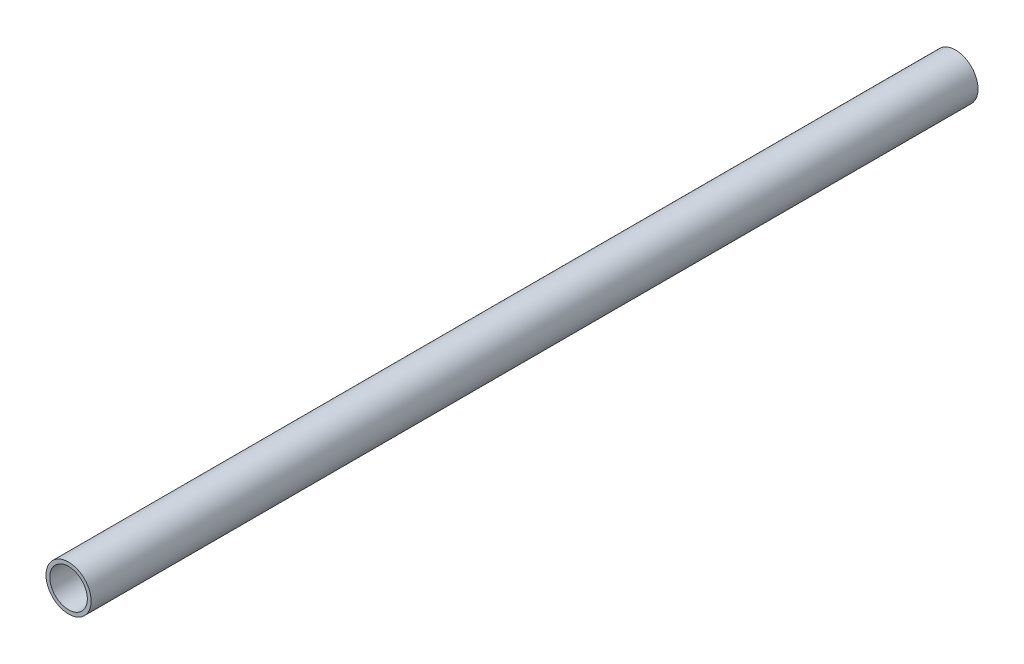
ISO-10303-21;
HEADER;
FILE_DESCRIPTION(('STEP AP214'),'2;1');
FILE_NAME('part.step','',(''),(''),'','','');
FILE_SCHEMA(('AUTOMOTIVE_DESIGN { 1 0 10303 214 1 1 1 1 }'));
ENDSEC;
DATA;
#1=APPLICATION_CONTEXT('core data for automotive mechanical design processes');
#2=APPLICATION_PROTOCOL_DEFINITION('international standard','automotive_design',2000,#1);
#3=PRODUCT_CONTEXT('',#1,'mechanical');
#4=PRODUCT('Part','Part','',(#3));
#5=PRODUCT_RELATED_PRODUCT_CATEGORY('part','',(#4));
#6=PRODUCT_DEFINITION_FORMATION('','',#4);
#7=PRODUCT_DEFINITION_CONTEXT('part definition',#1,'design');
#8=PRODUCT_DEFINITION('design','',#6,#7);
#9=PRODUCT_DEFINITION_SHAPE('','',#8);
#10=(LENGTH_UNIT() NAMED_UNIT(*) SI_UNIT(.MILLI.,.METRE.));
#11=(NAMED_UNIT(*) PLANE_ANGLE_UNIT() SI_UNIT($,.RADIAN.));
#12=(NAMED_UNIT(*) SI_UNIT($,.STERADIAN.) SOLID_ANGLE_UNIT());
#13=UNCERTAINTY_MEASURE_WITH_UNIT(LENGTH_MEASURE(1.E-05),#10,'distance_accuracy_value','');
#14=(GEOMETRIC_REPRESENTATION_CONTEXT(3) GLOBAL_UNCERTAINTY_ASSIGNED_CONTEXT((#13)) GLOBAL_UNIT_ASSIGNED_CONTEXT((#10,
#11,#12)) REPRESENTATION_CONTEXT('',''));
#15=CARTESIAN_POINT('',(0.,0.,0.));
#16=DIRECTION('',(0.,0.,1.));
#17=DIRECTION('',(1.,0.,0.));
#18=AXIS2_PLACEMENT_3D('',#15,#16,#17);
#19=CARTESIAN_POINT('',(0.,0.,236.));
#20=DIRECTION('',(0.,0.,-1.));
#21=DIRECTION('',(-1.,0.,0.));
#22=AXIS2_PLACEMENT_3D('',#19,#20,#21);
#23=CYLINDRICAL_SURFACE('',#22,5.);
#24=CARTESIAN_POINT('',(0.,0.,0.));
#25=DIRECTION('',(0.,0.,-1.));
#26=DIRECTION('',(-1.,0.,0.));
#27=AXIS2_PLACEMENT_3D('',#24,#25,#26);
#28=CIRCLE('',#27,5.);
#29=CARTESIAN_POINT('',(-5.,0.,0.));
#30=VERTEX_POINT('',#29);
#31=EDGE_CURVE('E27',#30,#30,#28,.T.);
#32=ORIENTED_EDGE('',*,*,#31,.T.);
#33=EDGE_LOOP('',(#32));
#34=FACE_BOUND('',#33,.T.);
#35=CARTESIAN_POINT('',(0.,0.,236.));
#36=DIRECTION('',(0.,0.,-1.));
#37=DIRECTION('',(-1.,0.,0.));
#38=AXIS2_PLACEMENT_3D('',#35,#36,#37);
#39=CIRCLE('',#38,5.);
#40=CARTESIAN_POINT('',(-5.,0.,236.));
#41=VERTEX_POINT('',#40);
#42=EDGE_CURVE('E18',#41,#41,#39,.T.);
#43=ORIENTED_EDGE('',*,*,#42,.F.);
#44=EDGE_LOOP('',(#43));
#45=FACE_BOUND('',#44,.T.);
#46=ADVANCED_FACE('F15',(#34,#45),#23,.F.);
#47=CARTESIAN_POINT('',(0.,0.,236.));
#48=DIRECTION('',(0.,0.,1.));
#49=DIRECTION('',(1.,0.,0.));
#50=AXIS2_PLACEMENT_3D('',#47,#48,#49);
#51=PLANE('',#50);
#52=ORIENTED_EDGE('',*,*,#42,.T.);
#53=EDGE_LOOP('',(#52));
#54=FACE_BOUND('',#53,.T.);
#55=CARTESIAN_POINT('',(0.,0.,236.));
#56=DIRECTION('',(0.,0.,-1.));
#57=DIRECTION('',(-1.,0.,0.));
#58=AXIS2_PLACEMENT_3D('',#55,#56,#57);
#59=CIRCLE('',#58,6.);
#60=CARTESIAN_POINT('',(-6.,0.,236.));
#61=VERTEX_POINT('',#60);
#62=EDGE_CURVE('E22',#61,#61,#59,.T.);
#63=ORIENTED_EDGE('',*,*,#62,.F.);
#64=EDGE_LOOP('',(#63));
#65=FACE_BOUND('',#64,.T.);
#66=ADVANCED_FACE('F35',(#54,#65),#51,.T.);
#67=CARTESIAN_POINT('',(0.,0.,0.));
#68=DIRECTION('',(0.,0.,1.));
#69=DIRECTION('',(1.,0.,0.));
#70=AXIS2_PLACEMENT_3D('',#67,#68,#69);
#71=PLANE('',#70);
#72=ORIENTED_EDGE('',*,*,#31,.F.);
#73=EDGE_LOOP('',(#72));
#74=FACE_BOUND('',#73,.T.);
#75=CARTESIAN_POINT('',(0.,0.,0.));
#76=DIRECTION('',(0.,0.,-1.));
#77=DIRECTION('',(-1.,0.,0.));
#78=AXIS2_PLACEMENT_3D('',#75,#76,#77);
#79=CIRCLE('',#78,6.);
#80=CARTESIAN_POINT('',(-6.,0.,0.));
#81=VERTEX_POINT('',#80);
#82=EDGE_CURVE('E10',#81,#81,#79,.F.);
#83=ORIENTED_EDGE('',*,*,#82,.F.);
#84=EDGE_LOOP('',(#83));
#85=FACE_BOUND('',#84,.T.);
#86=ADVANCED_FACE('F43',(#74,#85),#71,.F.);
#87=CARTESIAN_POINT('',(0.,0.,236.));
#88=DIRECTION('',(0.,0.,-1.));
#89=DIRECTION('',(-1.,0.,0.));
#90=AXIS2_PLACEMENT_3D('',#87,#88,#89);
#91=CYLINDRICAL_SURFACE('',#90,6.);
#92=ORIENTED_EDGE('',*,*,#82,.T.);
#93=EDGE_LOOP('',(#92));
#94=FACE_BOUND('',#93,.T.);
#95=ORIENTED_EDGE('',*,*,#62,.T.);
#96=EDGE_LOOP('',(#95));
#97=FACE_BOUND('',#96,.T.);
#98=ADVANCED_FACE('F44',(#94,#97),#91,.T.);
#99=CLOSED_SHELL('',(#46,#66,#86,#98));
#100=MANIFOLD_SOLID_BREP('B1',#99);
#101=ADVANCED_BREP_SHAPE_REPRESENTATION('',(#18,#100),#14);
#102=SHAPE_DEFINITION_REPRESENTATION(#9,#101);
ENDSEC;
END-ISO-10303-21;
